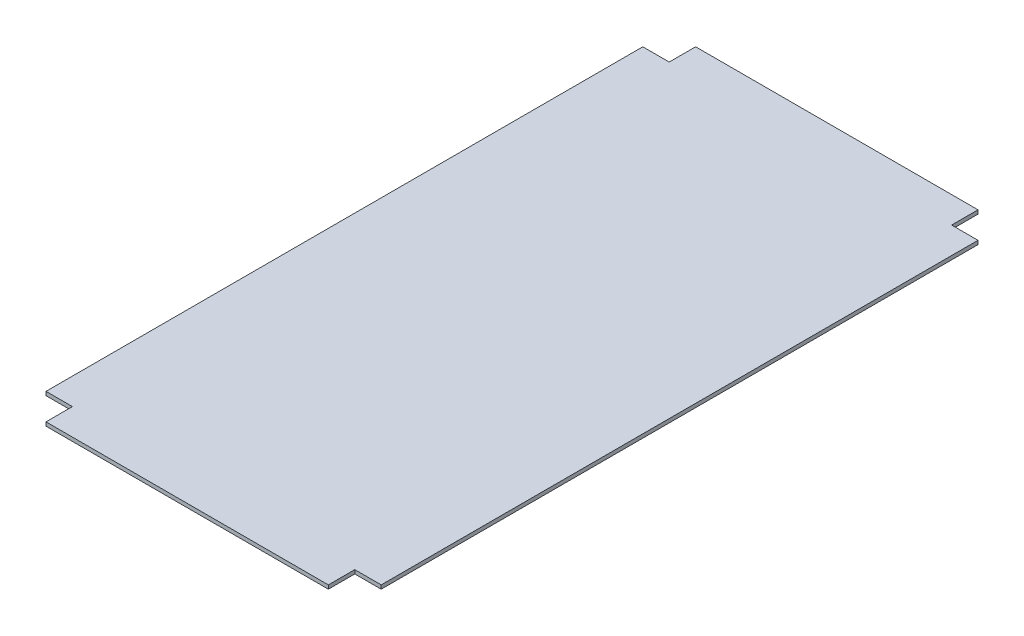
from build123d import *

# Parameters (mm, degrees)
CROQUIS1_W     = 533
CROQUIS1_H     = 6
EXTRUIR1_DEPTH = 516.5
CROQUIS2_W     = 42
CROQUIS2_H     = 42
ESQUINAS_DEPTH = 582.231881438


with BuildPart() as part:
    # Croquis1 → Extruir1 (new, symmetric)
    with BuildSketch(Plane.XY):
        Rectangle(CROQUIS1_W, CROQUIS1_H)
    extrude(amount=EXTRUIR1_DEPTH, both=True)

    # Croquis2 → Esquinas (cut, through all)
    with BuildSketch(Plane(origin=(0, 3, 0), x_dir=(1, 0, 0), z_dir=(0, 1, 0))):
        with Locations((-245.5, 495.5)):
            Rectangle(CROQUIS2_W, CROQUIS2_H)
        with Locations((-245.5, -495.5)):
            Rectangle(CROQUIS2_W, CROQUIS2_H)
        with Locations((245.5, 495.5)):
            Rectangle(CROQUIS2_W, CROQUIS2_H)
        with Locations((245.5, -495.5)):
            Rectangle(CROQUIS2_W, CROQUIS2_H)
    extrude(amount=-ESQUINAS_DEPTH, mode=Mode.SUBTRACT)


solid = part.part
